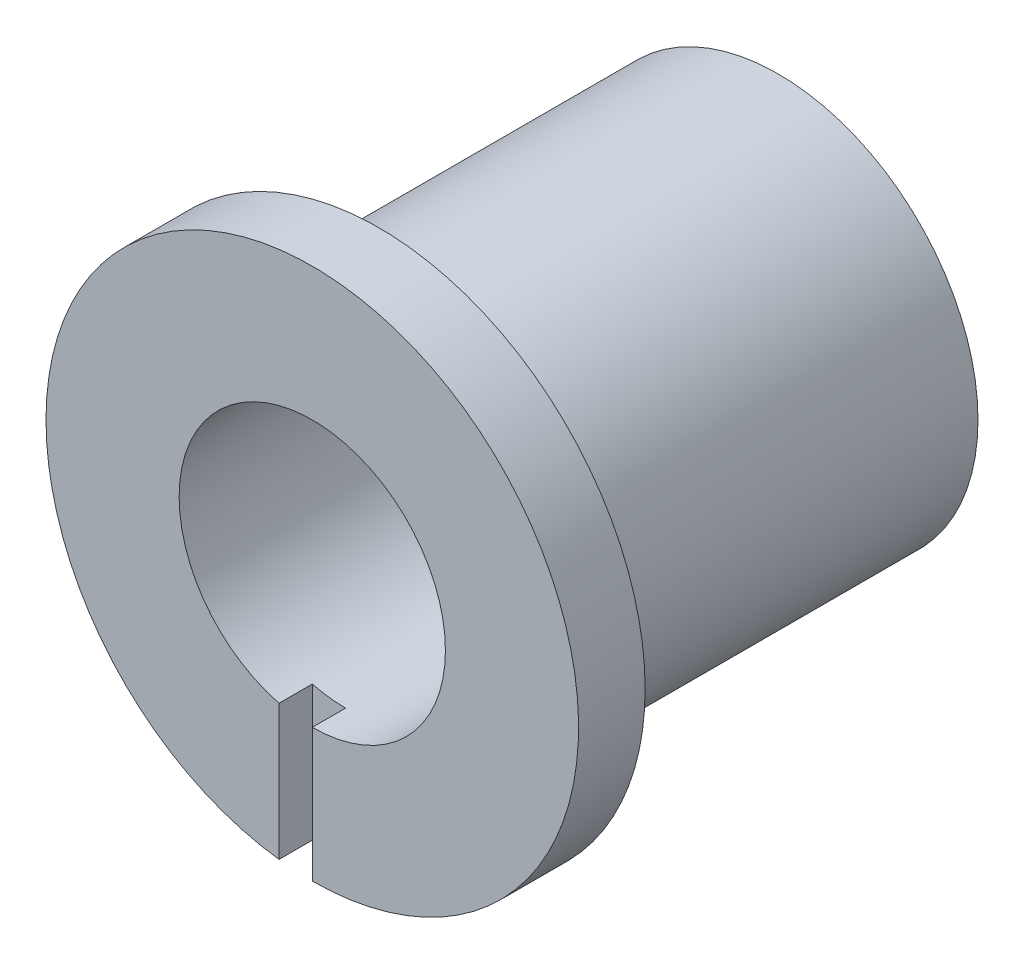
from build123d import *

# Parameters (mm, degrees)
SKIZZE1_R                       = 30
LINEAR_AUSTRAGEN1_DEPTH         = 60
SKIZZE2_R                       = 40
LINEAR_AUSTRAGEN2_DEPTH         = 10
SKIZZE3_R                       = 20
SCHNITT_LINEAR_AUSTRAGEN1_DEPTH = 91
SKIZZE4_W                       = 5
SKIZZE4_H                       = 80
SCHNITT_LINEAR_AUSTRAGEN2_DEPTH = 5


with BuildPart() as part:
    # Skizze1 → Linear austragen1 (new body)
    with BuildSketch(Plane.XY):
        Circle(SKIZZE1_R)
    extrude(amount=LINEAR_AUSTRAGEN1_DEPTH)

    # Skizze2 → Linear austragen2 (add)
    with BuildSketch(Plane.XY.offset(60)):
        Circle(SKIZZE2_R)
    extrude(amount=LINEAR_AUSTRAGEN2_DEPTH)

    # Skizze3 → Schnitt-Linear austragen1 (cut, through all)
    with BuildSketch(Plane.XY.offset(70)):
        Circle(SKIZZE3_R)
    extrude(amount=-SCHNITT_LINEAR_AUSTRAGEN1_DEPTH, mode=Mode.SUBTRACT)

    # Skizze4 → Schnitt-Linear austragen2 (cut)
    with BuildSketch(Plane.XY.offset(70)):
        with Locations((-2.5, -40)):
            Rectangle(SKIZZE4_W, SKIZZE4_H)
    extrude(amount=-SCHNITT_LINEAR_AUSTRAGEN2_DEPTH, mode=Mode.SUBTRACT)


solid = part.part
